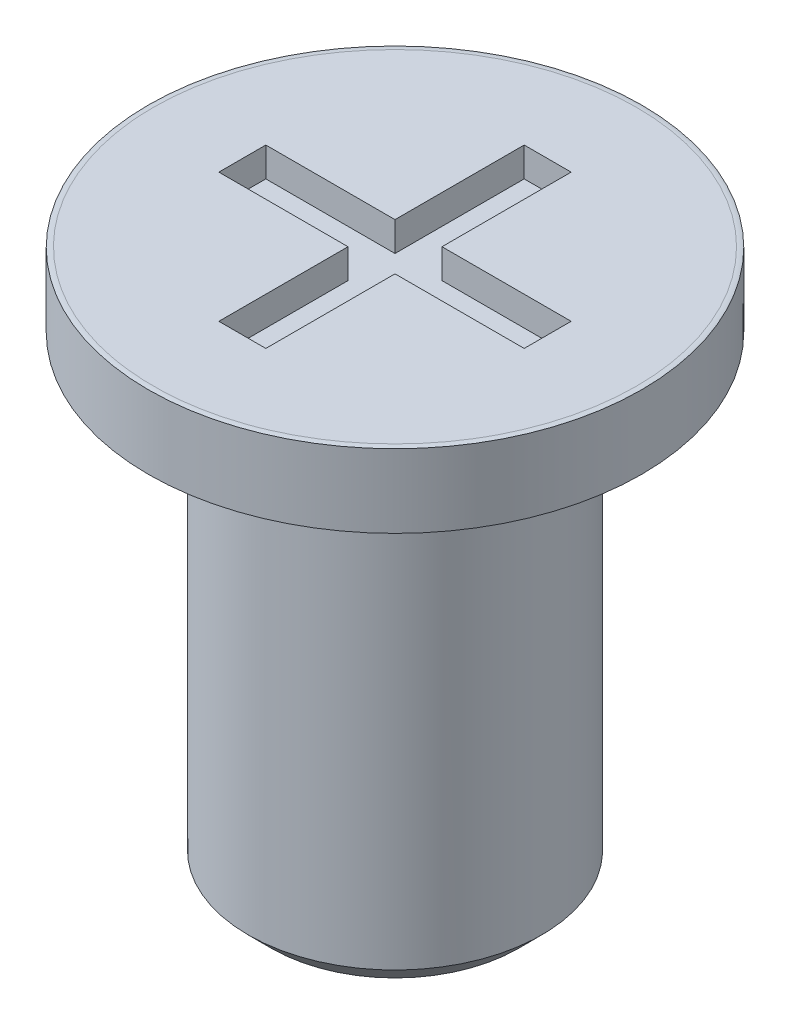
ISO-10303-21;
HEADER;
FILE_DESCRIPTION(('STEP AP214'),'2;1');
FILE_NAME('part.step','',(''),(''),'','','');
FILE_SCHEMA(('AUTOMOTIVE_DESIGN { 1 0 10303 214 1 1 1 1 }'));
ENDSEC;
DATA;
#1=APPLICATION_CONTEXT('core data for automotive mechanical design processes');
#2=APPLICATION_PROTOCOL_DEFINITION('international standard','automotive_design',2000,#1);
#3=PRODUCT_CONTEXT('',#1,'mechanical');
#4=PRODUCT('Part','Part','',(#3));
#5=PRODUCT_RELATED_PRODUCT_CATEGORY('part','',(#4));
#6=PRODUCT_DEFINITION_FORMATION('','',#4);
#7=PRODUCT_DEFINITION_CONTEXT('part definition',#1,'design');
#8=PRODUCT_DEFINITION('design','',#6,#7);
#9=PRODUCT_DEFINITION_SHAPE('','',#8);
#10=(LENGTH_UNIT() NAMED_UNIT(*) SI_UNIT(.MILLI.,.METRE.));
#11=(NAMED_UNIT(*) PLANE_ANGLE_UNIT() SI_UNIT($,.RADIAN.));
#12=(NAMED_UNIT(*) SI_UNIT($,.STERADIAN.) SOLID_ANGLE_UNIT());
#13=UNCERTAINTY_MEASURE_WITH_UNIT(LENGTH_MEASURE(1.E-05),#10,'distance_accuracy_value','');
#14=(GEOMETRIC_REPRESENTATION_CONTEXT(3) GLOBAL_UNCERTAINTY_ASSIGNED_CONTEXT((#13)) GLOBAL_UNIT_ASSIGNED_CONTEXT((#10,
#11,#12)) REPRESENTATION_CONTEXT('',''));
#15=CARTESIAN_POINT('',(0.,0.,0.));
#16=DIRECTION('',(0.,0.,1.));
#17=DIRECTION('',(1.,0.,0.));
#18=AXIS2_PLACEMENT_3D('',#15,#16,#17);
#19=CARTESIAN_POINT('',(0.,1.814213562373,0.));
#20=DIRECTION('',(0.,1.,0.));
#21=DIRECTION('',(0.,0.,1.));
#22=AXIS2_PLACEMENT_3D('',#19,#20,#21);
#23=PLANE('',#22);
#24=DIRECTION('',(0.,0.,1.));
#25=VECTOR('',#24,1.);
#26=CARTESIAN_POINT('',(-0.2,1.814213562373,0.2));
#27=LINE('',#26,#25);
#28=CARTESIAN_POINT('',(-0.2,1.814213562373,0.2));
#29=VERTEX_POINT('',#28);
#30=CARTESIAN_POINT('',(-0.2,1.814213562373,1.3));
#31=VERTEX_POINT('',#30);
#32=EDGE_CURVE('E321',#29,#31,#27,.T.);
#33=ORIENTED_EDGE('',*,*,#32,.T.);
#34=DIRECTION('',(1.,0.,0.));
#35=VECTOR('',#34,1.);
#36=CARTESIAN_POINT('',(0.,1.814213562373,1.3));
#37=LINE('',#36,#35);
#38=CARTESIAN_POINT('',(0.2,1.814213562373,1.3));
#39=VERTEX_POINT('',#38);
#40=EDGE_CURVE('E140',#31,#39,#37,.T.);
#41=ORIENTED_EDGE('',*,*,#40,.T.);
#42=DIRECTION('',(0.,0.,-1.));
#43=VECTOR('',#42,1.);
#44=CARTESIAN_POINT('',(0.2,1.814213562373,1.3));
#45=LINE('',#44,#43);
#46=CARTESIAN_POINT('',(0.2,1.814213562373,0.2));
#47=VERTEX_POINT('',#46);
#48=EDGE_CURVE('E137',#39,#47,#45,.T.);
#49=ORIENTED_EDGE('',*,*,#48,.T.);
#50=DIRECTION('',(1.,0.,0.));
#51=VECTOR('',#50,1.);
#52=CARTESIAN_POINT('',(0.2,1.814213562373,0.2));
#53=LINE('',#52,#51);
#54=CARTESIAN_POINT('',(1.3,1.814213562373,0.2));
#55=VERTEX_POINT('',#54);
#56=EDGE_CURVE('E134',#47,#55,#53,.T.);
#57=ORIENTED_EDGE('',*,*,#56,.T.);
#58=DIRECTION('',(0.,0.,-1.));
#59=VECTOR('',#58,1.);
#60=CARTESIAN_POINT('',(1.3,1.814213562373,0.2));
#61=LINE('',#60,#59);
#62=CARTESIAN_POINT('',(1.3,1.814213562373,-0.2));
#63=VERTEX_POINT('',#62);
#64=EDGE_CURVE('E157',#55,#63,#61,.T.);
#65=ORIENTED_EDGE('',*,*,#64,.T.);
#66=DIRECTION('',(-1.,0.,0.));
#67=VECTOR('',#66,1.);
#68=CARTESIAN_POINT('',(1.3,1.814213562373,-0.2));
#69=LINE('',#68,#67);
#70=CARTESIAN_POINT('',(0.2,1.814213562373,-0.2));
#71=VERTEX_POINT('',#70);
#72=EDGE_CURVE('E356',#63,#71,#69,.T.);
#73=ORIENTED_EDGE('',*,*,#72,.T.);
#74=DIRECTION('',(0.,0.,-1.));
#75=VECTOR('',#74,1.);
#76=CARTESIAN_POINT('',(0.2,1.814213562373,-0.2));
#77=LINE('',#76,#75);
#78=CARTESIAN_POINT('',(0.2,1.814213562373,-1.3));
#79=VERTEX_POINT('',#78);
#80=EDGE_CURVE('E351',#71,#79,#77,.T.);
#81=ORIENTED_EDGE('',*,*,#80,.T.);
#82=DIRECTION('',(-1.,0.,0.));
#83=VECTOR('',#82,1.);
#84=CARTESIAN_POINT('',(0.2,1.814213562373,-1.3));
#85=LINE('',#84,#83);
#86=CARTESIAN_POINT('',(-0.2,1.814213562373,-1.3));
#87=VERTEX_POINT('',#86);
#88=EDGE_CURVE('E346',#79,#87,#85,.T.);
#89=ORIENTED_EDGE('',*,*,#88,.T.);
#90=DIRECTION('',(0.,0.,1.));
#91=VECTOR('',#90,1.);
#92=CARTESIAN_POINT('',(-0.2,1.814213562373,-1.3));
#93=LINE('',#92,#91);
#94=CARTESIAN_POINT('',(-0.2,1.814213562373,-0.2));
#95=VERTEX_POINT('',#94);
#96=EDGE_CURVE('E341',#87,#95,#93,.T.);
#97=ORIENTED_EDGE('',*,*,#96,.T.);
#98=DIRECTION('',(-1.,0.,0.));
#99=VECTOR('',#98,1.);
#100=CARTESIAN_POINT('',(-0.2,1.814213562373,-0.2));
#101=LINE('',#100,#99);
#102=CARTESIAN_POINT('',(-1.3,1.814213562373,-0.2));
#103=VERTEX_POINT('',#102);
#104=EDGE_CURVE('E336',#95,#103,#101,.T.);
#105=ORIENTED_EDGE('',*,*,#104,.T.);
#106=DIRECTION('',(0.,0.,1.));
#107=VECTOR('',#106,1.);
#108=CARTESIAN_POINT('',(-1.3,1.814213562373,-0.2));
#109=LINE('',#108,#107);
#110=CARTESIAN_POINT('',(-1.3,1.814213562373,0.2));
#111=VERTEX_POINT('',#110);
#112=EDGE_CURVE('E331',#103,#111,#109,.T.);
#113=ORIENTED_EDGE('',*,*,#112,.T.);
#114=DIRECTION('',(1.,0.,0.));
#115=VECTOR('',#114,1.);
#116=CARTESIAN_POINT('',(-1.3,1.814213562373,0.2));
#117=LINE('',#116,#115);
#118=EDGE_CURVE('E326',#111,#29,#117,.T.);
#119=ORIENTED_EDGE('',*,*,#118,.T.);
#120=EDGE_LOOP('',(#33,#41,#49,#57,#65,#73,#81,#89,#97,#105,#113,#119));
#121=FACE_BOUND('',#120,.T.);
#122=ADVANCED_FACE('F17',(#121),#23,.T.);
#123=CARTESIAN_POINT('',(0.2,3.214213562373,1.3));
#124=DIRECTION('',(1.,0.,0.));
#125=DIRECTION('',(0.,0.,-1.));
#126=AXIS2_PLACEMENT_3D('',#123,#124,#125);
#127=PLANE('',#126);
#128=ORIENTED_EDGE('',*,*,#48,.F.);
#129=DIRECTION('',(0.,1.,0.));
#130=VECTOR('',#129,1.);
#131=CARTESIAN_POINT('',(0.2,3.214213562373,1.3));
#132=LINE('',#131,#130);
#133=CARTESIAN_POINT('',(0.2,2.064213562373,1.3));
#134=VERTEX_POINT('',#133);
#135=EDGE_CURVE('E310',#39,#134,#132,.T.);
#136=ORIENTED_EDGE('',*,*,#135,.T.);
#137=DIRECTION('',(0.,0.,-1.));
#138=VECTOR('',#137,1.);
#139=CARTESIAN_POINT('',(0.2,2.064213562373,2.5));
#140=LINE('',#139,#138);
#141=CARTESIAN_POINT('',(0.2,2.064213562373,0.2));
#142=VERTEX_POINT('',#141);
#143=EDGE_CURVE('E148',#134,#142,#140,.T.);
#144=ORIENTED_EDGE('',*,*,#143,.T.);
#145=DIRECTION('',(0.,1.,0.));
#146=VECTOR('',#145,1.);
#147=CARTESIAN_POINT('',(0.2,3.214213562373,0.2));
#148=LINE('',#147,#146);
#149=EDGE_CURVE('E143',#142,#47,#148,.F.);
#150=ORIENTED_EDGE('',*,*,#149,.T.);
#151=EDGE_LOOP('',(#128,#136,#144,#150));
#152=FACE_BOUND('',#151,.T.);
#153=ADVANCED_FACE('F146',(#152),#127,.F.);
#154=CARTESIAN_POINT('',(0.2,3.214213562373,0.2));
#155=DIRECTION('',(0.,0.,1.));
#156=DIRECTION('',(1.,0.,0.));
#157=AXIS2_PLACEMENT_3D('',#154,#155,#156);
#158=PLANE('',#157);
#159=ORIENTED_EDGE('',*,*,#56,.F.);
#160=ORIENTED_EDGE('',*,*,#149,.F.);
#161=DIRECTION('',(1.,0.,0.));
#162=VECTOR('',#161,1.);
#163=CARTESIAN_POINT('',(-2.5,2.064213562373,0.2));
#164=LINE('',#163,#162);
#165=CARTESIAN_POINT('',(1.3,2.064213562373,0.2));
#166=VERTEX_POINT('',#165);
#167=EDGE_CURVE('E420',#142,#166,#164,.T.);
#168=ORIENTED_EDGE('',*,*,#167,.T.);
#169=DIRECTION('',(0.,1.,0.));
#170=VECTOR('',#169,1.);
#171=CARTESIAN_POINT('',(1.3,3.214213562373,0.2));
#172=LINE('',#171,#170);
#173=EDGE_CURVE('E154',#166,#55,#172,.F.);
#174=ORIENTED_EDGE('',*,*,#173,.T.);
#175=EDGE_LOOP('',(#159,#160,#168,#174));
#176=FACE_BOUND('',#175,.T.);
#177=ADVANCED_FACE('F152',(#176),#158,.F.);
#178=CARTESIAN_POINT('',(1.3,3.214213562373,0.2));
#179=DIRECTION('',(1.,0.,0.));
#180=DIRECTION('',(0.,0.,-1.));
#181=AXIS2_PLACEMENT_3D('',#178,#179,#180);
#182=PLANE('',#181);
#183=ORIENTED_EDGE('',*,*,#64,.F.);
#184=ORIENTED_EDGE('',*,*,#173,.F.);
#185=DIRECTION('',(0.,0.,-1.));
#186=VECTOR('',#185,1.);
#187=CARTESIAN_POINT('',(1.3,2.064213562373,2.5));
#188=LINE('',#187,#186);
#189=CARTESIAN_POINT('',(1.3,2.064213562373,-0.2));
#190=VERTEX_POINT('',#189);
#191=EDGE_CURVE('E365',#166,#190,#188,.T.);
#192=ORIENTED_EDGE('',*,*,#191,.T.);
#193=DIRECTION('',(0.,1.,0.));
#194=VECTOR('',#193,1.);
#195=CARTESIAN_POINT('',(1.3,3.214213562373,-0.2));
#196=LINE('',#195,#194);
#197=EDGE_CURVE('E358',#190,#63,#196,.F.);
#198=ORIENTED_EDGE('',*,*,#197,.T.);
#199=EDGE_LOOP('',(#183,#184,#192,#198));
#200=FACE_BOUND('',#199,.T.);
#201=ADVANCED_FACE('F363',(#200),#182,.F.);
#202=CARTESIAN_POINT('',(1.3,3.214213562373,-0.2));
#203=DIRECTION('',(0.,0.,-1.));
#204=DIRECTION('',(-1.,0.,0.));
#205=AXIS2_PLACEMENT_3D('',#202,#203,#204);
#206=PLANE('',#205);
#207=ORIENTED_EDGE('',*,*,#72,.F.);
#208=ORIENTED_EDGE('',*,*,#197,.F.);
#209=DIRECTION('',(1.,0.,0.));
#210=VECTOR('',#209,1.);
#211=CARTESIAN_POINT('',(-2.5,2.064213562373,-0.2));
#212=LINE('',#211,#210);
#213=CARTESIAN_POINT('',(0.2,2.064213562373,-0.2));
#214=VERTEX_POINT('',#213);
#215=EDGE_CURVE('E371',#190,#214,#212,.F.);
#216=ORIENTED_EDGE('',*,*,#215,.T.);
#217=DIRECTION('',(0.,1.,0.));
#218=VECTOR('',#217,1.);
#219=CARTESIAN_POINT('',(0.2,3.214213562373,-0.2));
#220=LINE('',#219,#218);
#221=EDGE_CURVE('E353',#214,#71,#220,.F.);
#222=ORIENTED_EDGE('',*,*,#221,.T.);
#223=EDGE_LOOP('',(#207,#208,#216,#222));
#224=FACE_BOUND('',#223,.T.);
#225=ADVANCED_FACE('F368',(#224),#206,.F.);
#226=CARTESIAN_POINT('',(0.2,3.214213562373,-0.2));
#227=DIRECTION('',(1.,0.,0.));
#228=DIRECTION('',(0.,0.,-1.));
#229=AXIS2_PLACEMENT_3D('',#226,#227,#228);
#230=PLANE('',#229);
#231=ORIENTED_EDGE('',*,*,#80,.F.);
#232=ORIENTED_EDGE('',*,*,#221,.F.);
#233=DIRECTION('',(0.,0.,-1.));
#234=VECTOR('',#233,1.);
#235=CARTESIAN_POINT('',(0.2,2.064213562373,2.5));
#236=LINE('',#235,#234);
#237=CARTESIAN_POINT('',(0.2,2.064213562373,-1.3));
#238=VERTEX_POINT('',#237);
#239=EDGE_CURVE('E425',#214,#238,#236,.T.);
#240=ORIENTED_EDGE('',*,*,#239,.T.);
#241=DIRECTION('',(0.,1.,0.));
#242=VECTOR('',#241,1.);
#243=CARTESIAN_POINT('',(0.2,3.214213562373,-1.3));
#244=LINE('',#243,#242);
#245=EDGE_CURVE('E348',#238,#79,#244,.F.);
#246=ORIENTED_EDGE('',*,*,#245,.T.);
#247=EDGE_LOOP('',(#231,#232,#240,#246));
#248=FACE_BOUND('',#247,.T.);
#249=ADVANCED_FACE('F374',(#248),#230,.F.);
#250=CARTESIAN_POINT('',(0.2,3.214213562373,-1.3));
#251=DIRECTION('',(0.,0.,-1.));
#252=DIRECTION('',(-1.,0.,0.));
#253=AXIS2_PLACEMENT_3D('',#250,#251,#252);
#254=PLANE('',#253);
#255=ORIENTED_EDGE('',*,*,#88,.F.);
#256=ORIENTED_EDGE('',*,*,#245,.F.);
#257=DIRECTION('',(1.,0.,0.));
#258=VECTOR('',#257,1.);
#259=CARTESIAN_POINT('',(-2.5,2.064213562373,-1.3));
#260=LINE('',#259,#258);
#261=CARTESIAN_POINT('',(-0.2,2.064213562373,-1.3));
#262=VERTEX_POINT('',#261);
#263=EDGE_CURVE('E382',#238,#262,#260,.F.);
#264=ORIENTED_EDGE('',*,*,#263,.T.);
#265=DIRECTION('',(0.,1.,0.));
#266=VECTOR('',#265,1.);
#267=CARTESIAN_POINT('',(-0.2,3.214213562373,-1.3));
#268=LINE('',#267,#266);
#269=EDGE_CURVE('E343',#262,#87,#268,.F.);
#270=ORIENTED_EDGE('',*,*,#269,.T.);
#271=EDGE_LOOP('',(#255,#256,#264,#270));
#272=FACE_BOUND('',#271,.T.);
#273=ADVANCED_FACE('F380',(#272),#254,.F.);
#274=CARTESIAN_POINT('',(-0.2,3.214213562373,-1.3));
#275=DIRECTION('',(-1.,0.,0.));
#276=DIRECTION('',(0.,0.,1.));
#277=AXIS2_PLACEMENT_3D('',#274,#275,#276);
#278=PLANE('',#277);
#279=ORIENTED_EDGE('',*,*,#96,.F.);
#280=ORIENTED_EDGE('',*,*,#269,.F.);
#281=DIRECTION('',(0.,0.,-1.));
#282=VECTOR('',#281,1.);
#283=CARTESIAN_POINT('',(-0.2,2.064213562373,2.5));
#284=LINE('',#283,#282);
#285=CARTESIAN_POINT('',(-0.2,2.064213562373,-0.2));
#286=VERTEX_POINT('',#285);
#287=EDGE_CURVE('E388',#262,#286,#284,.F.);
#288=ORIENTED_EDGE('',*,*,#287,.T.);
#289=DIRECTION('',(0.,1.,0.));
#290=VECTOR('',#289,1.);
#291=CARTESIAN_POINT('',(-0.2,3.214213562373,-0.2));
#292=LINE('',#291,#290);
#293=EDGE_CURVE('E338',#286,#95,#292,.F.);
#294=ORIENTED_EDGE('',*,*,#293,.T.);
#295=EDGE_LOOP('',(#279,#280,#288,#294));
#296=FACE_BOUND('',#295,.T.);
#297=ADVANCED_FACE('F385',(#296),#278,.F.);
#298=CARTESIAN_POINT('',(-0.2,3.214213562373,-0.2));
#299=DIRECTION('',(0.,0.,-1.));
#300=DIRECTION('',(-1.,0.,0.));
#301=AXIS2_PLACEMENT_3D('',#298,#299,#300);
#302=PLANE('',#301);
#303=ORIENTED_EDGE('',*,*,#104,.F.);
#304=ORIENTED_EDGE('',*,*,#293,.F.);
#305=DIRECTION('',(1.,0.,0.));
#306=VECTOR('',#305,1.);
#307=CARTESIAN_POINT('',(-2.5,2.064213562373,-0.2));
#308=LINE('',#307,#306);
#309=CARTESIAN_POINT('',(-1.3,2.064213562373,-0.2));
#310=VERTEX_POINT('',#309);
#311=EDGE_CURVE('E429',#286,#310,#308,.F.);
#312=ORIENTED_EDGE('',*,*,#311,.T.);
#313=DIRECTION('',(0.,1.,0.));
#314=VECTOR('',#313,1.);
#315=CARTESIAN_POINT('',(-1.3,3.214213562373,-0.2));
#316=LINE('',#315,#314);
#317=EDGE_CURVE('E333',#310,#103,#316,.F.);
#318=ORIENTED_EDGE('',*,*,#317,.T.);
#319=EDGE_LOOP('',(#303,#304,#312,#318));
#320=FACE_BOUND('',#319,.T.);
#321=ADVANCED_FACE('F391',(#320),#302,.F.);
#322=CARTESIAN_POINT('',(-1.3,3.214213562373,-0.2));
#323=DIRECTION('',(-1.,0.,0.));
#324=DIRECTION('',(0.,0.,1.));
#325=AXIS2_PLACEMENT_3D('',#322,#323,#324);
#326=PLANE('',#325);
#327=ORIENTED_EDGE('',*,*,#112,.F.);
#328=ORIENTED_EDGE('',*,*,#317,.F.);
#329=DIRECTION('',(0.,0.,-1.));
#330=VECTOR('',#329,1.);
#331=CARTESIAN_POINT('',(-1.3,2.064213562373,2.5));
#332=LINE('',#331,#330);
#333=CARTESIAN_POINT('',(-1.3,2.064213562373,0.2));
#334=VERTEX_POINT('',#333);
#335=EDGE_CURVE('E399',#310,#334,#332,.F.);
#336=ORIENTED_EDGE('',*,*,#335,.T.);
#337=DIRECTION('',(0.,1.,0.));
#338=VECTOR('',#337,1.);
#339=CARTESIAN_POINT('',(-1.3,3.214213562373,0.2));
#340=LINE('',#339,#338);
#341=EDGE_CURVE('E328',#334,#111,#340,.F.);
#342=ORIENTED_EDGE('',*,*,#341,.T.);
#343=EDGE_LOOP('',(#327,#328,#336,#342));
#344=FACE_BOUND('',#343,.T.);
#345=ADVANCED_FACE('F397',(#344),#326,.F.);
#346=CARTESIAN_POINT('',(-1.3,3.214213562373,0.2));
#347=DIRECTION('',(0.,0.,1.));
#348=DIRECTION('',(1.,0.,0.));
#349=AXIS2_PLACEMENT_3D('',#346,#347,#348);
#350=PLANE('',#349);
#351=ORIENTED_EDGE('',*,*,#118,.F.);
#352=ORIENTED_EDGE('',*,*,#341,.F.);
#353=DIRECTION('',(1.,0.,0.));
#354=VECTOR('',#353,1.);
#355=CARTESIAN_POINT('',(-2.5,2.064213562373,0.2));
#356=LINE('',#355,#354);
#357=CARTESIAN_POINT('',(-0.2,2.064213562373,0.2));
#358=VERTEX_POINT('',#357);
#359=EDGE_CURVE('E405',#334,#358,#356,.T.);
#360=ORIENTED_EDGE('',*,*,#359,.T.);
#361=DIRECTION('',(0.,1.,0.));
#362=VECTOR('',#361,1.);
#363=CARTESIAN_POINT('',(-0.2,3.214213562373,0.2));
#364=LINE('',#363,#362);
#365=EDGE_CURVE('E323',#358,#29,#364,.F.);
#366=ORIENTED_EDGE('',*,*,#365,.T.);
#367=EDGE_LOOP('',(#351,#352,#360,#366));
#368=FACE_BOUND('',#367,.T.);
#369=ADVANCED_FACE('F402',(#368),#350,.F.);
#370=CARTESIAN_POINT('',(-0.2,3.214213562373,0.2));
#371=DIRECTION('',(-1.,0.,0.));
#372=DIRECTION('',(0.,0.,1.));
#373=AXIS2_PLACEMENT_3D('',#370,#371,#372);
#374=PLANE('',#373);
#375=ORIENTED_EDGE('',*,*,#32,.F.);
#376=ORIENTED_EDGE('',*,*,#365,.F.);
#377=DIRECTION('',(0.,0.,-1.));
#378=VECTOR('',#377,1.);
#379=CARTESIAN_POINT('',(-0.2,2.064213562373,2.5));
#380=LINE('',#379,#378);
#381=CARTESIAN_POINT('',(-0.2,2.064213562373,1.3));
#382=VERTEX_POINT('',#381);
#383=EDGE_CURVE('E410',#358,#382,#380,.F.);
#384=ORIENTED_EDGE('',*,*,#383,.T.);
#385=DIRECTION('',(0.,1.,0.));
#386=VECTOR('',#385,1.);
#387=CARTESIAN_POINT('',(-0.2,3.214213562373,1.3));
#388=LINE('',#387,#386);
#389=EDGE_CURVE('E318',#382,#31,#388,.F.);
#390=ORIENTED_EDGE('',*,*,#389,.T.);
#391=EDGE_LOOP('',(#375,#376,#384,#390));
#392=FACE_BOUND('',#391,.T.);
#393=ADVANCED_FACE('F408',(#392),#374,.F.);
#394=CARTESIAN_POINT('',(0.,3.214213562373,1.3));
#395=DIRECTION('',(0.,0.,1.));
#396=DIRECTION('',(1.,0.,0.));
#397=AXIS2_PLACEMENT_3D('',#394,#395,#396);
#398=PLANE('',#397);
#399=ORIENTED_EDGE('',*,*,#40,.F.);
#400=ORIENTED_EDGE('',*,*,#389,.F.);
#401=DIRECTION('',(1.,0.,0.));
#402=VECTOR('',#401,1.);
#403=CARTESIAN_POINT('',(-2.5,2.064213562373,1.3));
#404=LINE('',#403,#402);
#405=EDGE_CURVE('E415',#382,#134,#404,.T.);
#406=ORIENTED_EDGE('',*,*,#405,.T.);
#407=ORIENTED_EDGE('',*,*,#135,.F.);
#408=EDGE_LOOP('',(#399,#400,#406,#407));
#409=FACE_BOUND('',#408,.T.);
#410=ADVANCED_FACE('F414',(#409),#398,.F.);
#411=CARTESIAN_POINT('',(-2.5,2.064213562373,2.5));
#412=DIRECTION('',(0.,-1.,0.));
#413=DIRECTION('',(0.,0.,-1.));
#414=AXIS2_PLACEMENT_3D('',#411,#412,#413);
#415=PLANE('',#414);
#416=ORIENTED_EDGE('',*,*,#383,.F.);
#417=ORIENTED_EDGE('',*,*,#359,.F.);
#418=ORIENTED_EDGE('',*,*,#335,.F.);
#419=ORIENTED_EDGE('',*,*,#311,.F.);
#420=ORIENTED_EDGE('',*,*,#287,.F.);
#421=ORIENTED_EDGE('',*,*,#263,.F.);
#422=ORIENTED_EDGE('',*,*,#239,.F.);
#423=ORIENTED_EDGE('',*,*,#215,.F.);
#424=ORIENTED_EDGE('',*,*,#191,.F.);
#425=ORIENTED_EDGE('',*,*,#167,.F.);
#426=ORIENTED_EDGE('',*,*,#143,.F.);
#427=ORIENTED_EDGE('',*,*,#405,.F.);
#428=EDGE_LOOP('',(#416,#417,#418,#419,#420,#421,#422,#423,#424,#425,#426,#427));
#429=FACE_BOUND('',#428,.T.);
#430=CARTESIAN_POINT('',(0.,2.064213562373,0.));
#431=DIRECTION('',(0.,-1.,0.));
#432=DIRECTION('',(-0.999999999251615,0.,3.86880995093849E-05));
#433=AXIS2_PLACEMENT_3D('',#430,#431,#432);
#434=CIRCLE('',#433,2.05635183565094);
#435=CARTESIAN_POINT('',(-2.056351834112,2.064213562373,7.95563444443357E-05));
#436=VERTEX_POINT('',#435);
#437=CARTESIAN_POINT('',(2.056351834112,2.064213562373,-7.95563444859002E-05));
#438=VERTEX_POINT('',#437);
#439=EDGE_CURVE('E288',#436,#438,#434,.T.);
#440=ORIENTED_EDGE('',*,*,#439,.F.);
#441=CARTESIAN_POINT('',(2.056351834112,2.064213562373,-7.95563444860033E-05));
#442=CARTESIAN_POINT('',(2.05635348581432,2.064213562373,0.0303189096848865));
#443=CARTESIAN_POINT('',(2.05568014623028,2.064213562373,0.0607173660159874));
#444=CARTESIAN_POINT('',(2.05298689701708,2.064213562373,0.121454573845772));
#445=CARTESIAN_POINT('',(2.05096698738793,2.064213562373,0.151793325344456));
#446=CARTESIAN_POINT('',(2.04558401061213,2.064213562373,0.212351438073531));
#447=CARTESIAN_POINT('',(2.04222094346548,2.06421356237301,0.242570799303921));
#448=CARTESIAN_POINT('',(2.03415841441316,2.06421356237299,0.30283072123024));
#449=CARTESIAN_POINT('',(2.02945895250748,2.06421356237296,0.332871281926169));
#450=CARTESIAN_POINT('',(2.01873283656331,2.06421356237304,0.392714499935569));
#451=CARTESIAN_POINT('',(2.0127061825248,2.06421356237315,0.42251715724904));
#452=CARTESIAN_POINT('',(1.99933753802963,2.06421356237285,0.481826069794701));
#453=CARTESIAN_POINT('',(1.99199554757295,2.06421356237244,0.511332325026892));
#454=CARTESIAN_POINT('',(1.97601068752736,2.06421356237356,0.5699900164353));
#455=CARTESIAN_POINT('',(1.96736781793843,2.0642135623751,0.599141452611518));
#456=CARTESIAN_POINT('',(1.94879811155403,2.0642135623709,0.657033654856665));
#457=CARTESIAN_POINT('',(1.93887127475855,2.06421356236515,0.685774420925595));
#458=CARTESIAN_POINT('',(1.92303259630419,2.06421356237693,0.728531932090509));
#459=CARTESIAN_POINT('',(1.91759478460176,2.06421356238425,0.742725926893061));
#460=CARTESIAN_POINT('',(1.905943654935,2.06421356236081,0.77216260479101));
#461=CARTESIAN_POINT('',(1.89970342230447,2.06421356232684,0.787394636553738));
#462=CARTESIAN_POINT('',(1.88044341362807,2.06421356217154,0.832860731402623));
#463=CARTESIAN_POINT('',(1.86688316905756,2.06421356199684,0.86286793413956));
#464=CARTESIAN_POINT('',(1.83835391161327,2.0642135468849,0.92220246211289));
#465=CARTESIAN_POINT('',(1.82338492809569,2.06421353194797,0.951529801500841));
#466=CARTESIAN_POINT('',(1.7920681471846,2.0642134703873,1.00944053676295));
#467=CARTESIAN_POINT('',(1.77572034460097,2.06421342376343,1.03802392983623));
#468=CARTESIAN_POINT('',(1.74594801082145,2.06421325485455,1.08733980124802));
#469=CARTESIAN_POINT('',(1.73281414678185,2.06421315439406,1.10824885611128));
#470=CARTESIAN_POINT('',(1.69674419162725,2.06421287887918,1.16340934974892));
#471=CARTESIAN_POINT('',(1.67313144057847,2.06421269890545,1.19722344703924));
#472=CARTESIAN_POINT('',(1.62877376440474,2.06421262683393,1.25669096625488));
#473=CARTESIAN_POINT('',(1.6084003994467,2.06421268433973,1.28262345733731));
#474=CARTESIAN_POINT('',(1.56642014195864,2.06421292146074,1.33346415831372));
#475=CARTESIAN_POINT('',(1.54481353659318,2.06421310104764,1.35837260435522));
#476=CARTESIAN_POINT('',(1.50031752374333,2.06421340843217,1.40699892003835));
#477=CARTESIAN_POINT('',(1.47742850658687,2.06421353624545,1.43071714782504));
#478=CARTESIAN_POINT('',(1.44390323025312,2.06421357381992,1.46420646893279));
#479=CARTESIAN_POINT('',(1.43360870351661,2.06421356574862,1.47432607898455));
#480=CARTESIAN_POINT('',(1.39402327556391,2.06421353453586,1.51241032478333));
#481=CARTESIAN_POINT('',(1.36398692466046,2.06421351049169,1.5396120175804));
#482=CARTESIAN_POINT('',(1.31391536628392,2.06421341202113,1.58236135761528));
#483=CARTESIAN_POINT('',(1.29434518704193,2.06421335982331,1.59845990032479));
#484=CARTESIAN_POINT('',(1.25898255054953,2.06421325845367,1.62646119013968));
#485=CARTESIAN_POINT('',(1.24330470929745,2.0642132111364,1.63850872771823));
#486=CARTESIAN_POINT('',(1.20097579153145,2.06421310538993,1.67005830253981));
#487=CARTESIAN_POINT('',(1.17401244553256,2.064213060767,1.68914497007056));
#488=CARTESIAN_POINT('',(1.13536162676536,2.06421304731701,1.71510554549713));
#489=CARTESIAN_POINT('',(1.12404720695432,2.0642130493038,1.7225409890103));
#490=CARTESIAN_POINT('',(1.10158012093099,2.06421306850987,1.73698179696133));
#491=CARTESIAN_POINT('',(1.09043143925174,2.06421308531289,1.74399335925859));
#492=CARTESIAN_POINT('',(1.0499112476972,2.06421315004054,1.76893350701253));
#493=CARTESIAN_POINT('',(1.02014800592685,2.06421320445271,1.78623182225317));
#494=CARTESIAN_POINT('',(0.963513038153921,2.06421329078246,1.81727699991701));
#495=CARTESIAN_POINT('',(0.936736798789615,2.06421332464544,1.83119884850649));
#496=CARTESIAN_POINT('',(0.889101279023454,2.06421337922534,1.85464880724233));
#497=CARTESIAN_POINT('',(0.868365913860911,2.06421340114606,1.86442896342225));
#498=CARTESIAN_POINT('',(0.829538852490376,2.06421343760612,1.88195543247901));
#499=CARTESIAN_POINT('',(0.811488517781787,2.06421345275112,1.88979365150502));
#500=CARTESIAN_POINT('',(0.765995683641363,2.06421348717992,1.90877673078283));
#501=CARTESIAN_POINT('',(0.738414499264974,2.06421350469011,1.91959194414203));
#502=CARTESIAN_POINT('',(0.694999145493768,2.06421352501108,1.93554670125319));
#503=CARTESIAN_POINT('',(0.679314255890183,2.06421353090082,1.94109637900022));
#504=CARTESIAN_POINT('',(0.65983763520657,2.06421353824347,1.94772098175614));
#505=CARTESIAN_POINT('',(0.656107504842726,2.06421353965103,1.94897769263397));
#506=CARTESIAN_POINT('',(0.644146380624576,2.06421353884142,1.95298009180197));
#507=CARTESIAN_POINT('',(0.635905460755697,2.06421353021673,1.9556961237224));
#508=CARTESIAN_POINT('',(0.598742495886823,2.064213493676,1.96767233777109));
#509=CARTESIAN_POINT('',(0.569619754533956,2.06421347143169,1.97631894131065));
#510=CARTESIAN_POINT('',(0.511021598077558,2.06421342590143,1.99231487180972));
#511=CARTESIAN_POINT('',(0.481546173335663,2.06421340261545,1.99966416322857));
#512=CARTESIAN_POINT('',(0.422294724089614,2.0642133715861,2.01303558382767));
#513=CARTESIAN_POINT('',(0.39251869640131,2.0642133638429,2.01905769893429));
#514=CARTESIAN_POINT('',(0.332727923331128,2.06421336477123,2.02976677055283));
#515=CARTESIAN_POINT('',(0.302713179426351,2.06421337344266,2.03445373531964));
#516=CARTESIAN_POINT('',(0.242504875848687,2.0642134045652,2.04248153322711));
#517=CARTESIAN_POINT('',(0.212311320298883,2.06421342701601,2.04582239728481));
#518=CARTESIAN_POINT('',(0.151806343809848,2.06421347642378,2.05115343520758));
#519=CARTESIAN_POINT('',(0.121494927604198,2.06421350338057,2.05314366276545));
#520=CARTESIAN_POINT('',(0.0608151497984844,2.06421354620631,2.05576270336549));
#521=CARTESIAN_POINT('',(0.0304467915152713,2.06421356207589,2.05639159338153));
#522=CARTESIAN_POINT('',(-0.0302816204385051,2.06421356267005,2.05631208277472));
#523=CARTESIAN_POINT('',(-0.0606416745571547,2.06421354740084,2.05560394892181));
#524=CARTESIAN_POINT('',(-0.121299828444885,2.06421352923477,2.0528769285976));
#525=CARTESIAN_POINT('',(-0.151597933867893,2.06421352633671,2.05085816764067));
#526=CARTESIAN_POINT('',(-0.212076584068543,2.06421353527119,2.04550897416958));
#527=CARTESIAN_POINT('',(-0.242257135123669,2.06421354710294,2.04217861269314));
#528=CARTESIAN_POINT('',(-0.30244448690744,2.06421356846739,2.0342078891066));
#529=CARTESIAN_POINT('',(-0.332451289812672,2.06421357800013,2.0295675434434));
#530=CARTESIAN_POINT('',(-0.387968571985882,2.06421349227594,2.01976333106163));
#531=CARTESIAN_POINT('',(-0.41350915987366,2.0642134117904,2.01476888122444));
#532=CARTESIAN_POINT('',(-0.472859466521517,2.06421320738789,2.00194614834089));
#533=CARTESIAN_POINT('',(-0.506586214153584,2.06421307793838,1.99372827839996));
#534=CARTESIAN_POINT('',(-0.56934457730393,2.06421317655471,1.97660956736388));
#535=CARTESIAN_POINT('',(-0.598434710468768,2.06421336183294,1.96792352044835));
#536=CARTESIAN_POINT('',(-0.635534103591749,2.06421351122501,1.9558481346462));
#537=CARTESIAN_POINT('',(-0.643757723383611,2.06421353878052,1.95310761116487));
#538=CARTESIAN_POINT('',(-0.664146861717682,2.06421357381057,1.94620140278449));
#539=CARTESIAN_POINT('',(-0.67629598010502,2.06421356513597,1.94198726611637));
#540=CARTESIAN_POINT('',(-0.718475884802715,2.06421354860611,1.92694924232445));
#541=CARTESIAN_POINT('',(-0.748317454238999,2.06421356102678,1.91558740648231));
#542=CARTESIAN_POINT('',(-0.808209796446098,2.0642135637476,1.89118866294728));
#543=CARTESIAN_POINT('',(-0.838246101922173,2.06421355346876,1.87811610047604));
#544=CARTESIAN_POINT('',(-0.876479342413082,2.06421351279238,1.86038617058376));
#545=CARTESIAN_POINT('',(-0.884979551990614,2.06421350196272,1.85637380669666));
#546=CARTESIAN_POINT('',(-0.923103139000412,2.06421344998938,1.83805364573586));
#547=CARTESIAN_POINT('',(-0.952412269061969,2.06421340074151,1.82308264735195));
#548=CARTESIAN_POINT('',(-1.01027015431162,2.06421331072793,1.79173949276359));
#549=CARTESIAN_POINT('',(-1.03881888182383,2.06421326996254,1.77536728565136));
#550=CARTESIAN_POINT('',(-1.09509019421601,2.06421321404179,1.74125795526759));
#551=CARTESIAN_POINT('',(-1.12281276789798,2.06421319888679,1.72352081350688));
#552=CARTESIAN_POINT('',(-1.17736629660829,2.06421319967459,1.68672518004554));
#553=CARTESIAN_POINT('',(-1.2041972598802,2.06421321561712,1.66766670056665));
#554=CARTESIAN_POINT('',(-1.25690081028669,2.06421327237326,1.62827003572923));
#555=CARTESIAN_POINT('',(-1.28277342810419,2.06421331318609,1.60793189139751));
#556=CARTESIAN_POINT('',(-1.33351129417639,2.06421340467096,1.56603706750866));
#557=CARTESIAN_POINT('',(-1.35837659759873,2.06421345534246,1.54448045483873));
#558=CARTESIAN_POINT('',(-1.40699493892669,2.06421353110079,1.50015218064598));
#559=CARTESIAN_POINT('',(-1.43074806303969,2.0642135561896,1.47738061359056));
#560=CARTESIAN_POINT('',(-1.46700429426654,2.06421356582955,1.44111187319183));
#561=CARTESIAN_POINT('',(-1.47984917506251,2.06421356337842,1.42795327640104));
#562=CARTESIAN_POINT('',(-1.50754976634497,2.06421355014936,1.39880595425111));
#563=CARTESIAN_POINT('',(-1.5223327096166,2.06421353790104,1.38274785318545));
#564=CARTESIAN_POINT('',(-1.5568862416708,2.06421348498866,1.34400112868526));
#565=CARTESIAN_POINT('',(-1.57642506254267,2.06421343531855,1.32110493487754));
#566=CARTESIAN_POINT('',(-1.60552526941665,2.06421333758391,1.28544281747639));
#567=CARTESIAN_POINT('',(-1.61545705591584,2.06421329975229,1.27297733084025));
#568=CARTESIAN_POINT('',(-1.63451254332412,2.06421322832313,1.2484732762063));
#569=CARTESIAN_POINT('',(-1.64365135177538,2.06421319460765,1.23644643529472));
#570=CARTESIAN_POINT('',(-1.67564028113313,2.0642130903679,1.19335409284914));
#571=CARTESIAN_POINT('',(-1.69774381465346,2.06421304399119,1.16172698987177));
#572=CARTESIAN_POINT('',(-1.73249895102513,2.06421304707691,1.10883212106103));
#573=CARTESIAN_POINT('',(-1.7456963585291,2.06421306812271,1.08791900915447));
#574=CARTESIAN_POINT('',(-1.77559388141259,2.06421313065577,1.03857925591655));
#575=CARTESIAN_POINT('',(-1.79199595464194,2.0642131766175,1.00997085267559));
#576=CARTESIAN_POINT('',(-1.82338940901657,2.06421328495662,0.951995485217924));
#577=CARTESIAN_POINT('',(-1.83838092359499,2.06421334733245,0.922628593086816));
#578=CARTESIAN_POINT('',(-1.86692233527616,2.0642134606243,0.863204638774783));
#579=CARTESIAN_POINT('',(-1.88047239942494,2.06421351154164,0.833147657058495));
#580=CARTESIAN_POINT('',(-1.89968626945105,2.06421355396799,0.787598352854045));
#581=CARTESIAN_POINT('',(-1.90590561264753,2.06421356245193,0.772338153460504));
#582=CARTESIAN_POINT('',(-1.91751053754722,2.0642135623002,0.742865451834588));
#583=CARTESIAN_POINT('',(-1.92292335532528,2.0642135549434,0.728663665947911));
#584=CARTESIAN_POINT('',(-1.93870198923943,2.06421353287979,0.685893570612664));
#585=CARTESIAN_POINT('',(-1.94861028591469,2.06421351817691,0.657155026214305));
#586=CARTESIAN_POINT('',(-1.96718538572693,2.06421351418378,0.599284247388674));
#587=CARTESIAN_POINT('',(-1.97585235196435,2.06421352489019,0.570152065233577));
#588=CARTESIAN_POINT('',(-1.99191069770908,2.06421357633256,0.511540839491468));
#589=CARTESIAN_POINT('',(-1.99930216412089,2.06421361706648,0.482061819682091));
#590=CARTESIAN_POINT('',(-2.01117864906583,2.06421345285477,0.430230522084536));
#591=CARTESIAN_POINT('',(-2.01592832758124,2.06421330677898,0.407938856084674));
#592=CARTESIAN_POINT('',(-2.02505254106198,2.06421318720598,0.360608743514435));
#593=CARTESIAN_POINT('',(-2.02932079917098,2.06421323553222,0.335549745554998));
#594=CARTESIAN_POINT('',(-2.03894985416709,2.06421335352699,0.271950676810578));
#595=CARTESIAN_POINT('',(-2.04368783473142,2.06421342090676,0.233315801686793));
#596=CARTESIAN_POINT('',(-2.05124468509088,2.0642135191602,0.152729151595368));
#597=CARTESIAN_POINT('',(-2.05387912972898,2.06421354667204,0.110759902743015));
#598=CARTESIAN_POINT('',(-2.05598936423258,2.06421356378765,0.0458685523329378));
#599=CARTESIAN_POINT('',(-2.05635710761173,2.06421356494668,0.0229727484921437));
#600=CARTESIAN_POINT('',(-2.056351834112,2.064213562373,7.95563444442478E-05));
#601=B_SPLINE_CURVE_WITH_KNOTS('',3,(#441,#442,#443,#444,#445,#446,#447,#448,#449,#450,#451,
#452,#453,#454,#455,#456,#457,#458,#459,#460,#461,#462,#463,#464,#465,#466,#467,#468,#469,#470,
#471,#472,#473,#474,#475,#476,#477,#478,#479,#480,#481,#482,#483,#484,#485,#486,#487,#488,#489,
#490,#491,#492,#493,#494,#495,#496,#497,#498,#499,#500,#501,#502,#503,#504,#505,#506,#507,#508,
#509,#510,#511,#512,#513,#514,#515,#516,#517,#518,#519,#520,#521,#522,#523,#524,#525,#526,#527,
#528,#529,#530,#531,#532,#533,#534,#535,#536,#537,#538,#539,#540,#541,#542,#543,#544,#545,#546,
#547,#548,#549,#550,#551,#552,#553,#554,#555,#556,#557,#558,#559,#560,#561,#562,#563,#564,#565,
#566,#567,#568,#569,#570,#571,#572,#573,#574,#575,#576,#577,#578,#579,#580,#581,#582,#583,#584,
#585,#586,#587,#588,#589,#590,#591,#592,#593,#594,#595,#596,#597,#598,#599,#600),.UNSPECIFIED.,
.F.,.F.,(4,2,2,2,2,2,2,2,2,2,2,2,2,2,2,2,2,2,2,2,2,2,2,2,2,2,2,2,2,2,2,2,2,2,2,2,2,2,2,2,2,2,2,
2,2,2,2,2,2,2,2,2,2,2,2,2,2,2,2,2,2,2,2,2,2,2,2,2,2,2,2,2,2,2,2,2,2,2,2,4),(0.,
0.0911878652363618,0.182375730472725,0.273563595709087,0.364751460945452,0.455939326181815,
0.547127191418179,0.638315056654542,0.729502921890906,0.775099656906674,0.824477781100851,
0.923223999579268,1.02196816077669,1.12071269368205,1.1947758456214,1.31841415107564,
1.41731323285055,1.51618937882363,1.61503559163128,1.65834179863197,1.7798232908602,
1.85583086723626,1.91514010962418,2.01419845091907,2.05481310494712,2.09432184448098,
2.19754792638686,2.28805730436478,2.35682260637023,2.41585182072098,2.50469794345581,
2.55460666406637,2.56641504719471,2.59244561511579,2.68354799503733,2.7746528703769,
2.86575871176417,2.95686398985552,3.04796717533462,3.13906673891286,3.23016115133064,
3.32123739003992,3.41230490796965,3.5033674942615,3.59442893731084,3.67248518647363,
3.77657359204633,3.86761226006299,3.89361663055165,3.93219316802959,4.02795385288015,
4.126185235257,4.15438386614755,4.25307360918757,4.35176693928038,4.45046160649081,
4.5491553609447,4.64784595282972,4.74653113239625,4.84520864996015,4.90036986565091,
4.9658387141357,5.05610602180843,5.10391685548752,5.14922946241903,5.26491006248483,
5.33908453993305,5.43797309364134,5.53685228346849,5.63572000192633,5.68515253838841,
5.73074445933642,5.82191043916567,5.91306442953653,6.00421220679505,6.07257473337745,
6.14881388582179,6.26552432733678,6.39159658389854,6.46027920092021),.UNSPECIFIED.);
#602=EDGE_CURVE('E417',#438,#436,#601,.T.);
#603=ORIENTED_EDGE('',*,*,#602,.F.);
#604=EDGE_LOOP('',(#440,#603));
#605=FACE_BOUND('',#604,.T.);
#606=ADVANCED_FACE('F298',(#429,#605),#415,.F.);
#607=CARTESIAN_POINT('',(0.,1.864213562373,0.));
#608=DIRECTION('',(0.,-1.,0.));
#609=DIRECTION('',(-0.999999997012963,0.,7.72921300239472E-05));
#610=AXIS2_PLACEMENT_3D('',#607,#608,#609);
#611=TOROIDAL_SURFACE('',#610,2.056351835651,0.2);
#612=ORIENTED_EDGE('',*,*,#602,.T.);
#613=ORIENTED_EDGE('',*,*,#439,.T.);
#614=EDGE_LOOP('',(#612,#613));
#615=FACE_BOUND('',#614,.T.);
#616=CARTESIAN_POINT('',(0.,2.059392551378,0.));
#617=DIRECTION('',(0.,1.,0.));
#618=DIRECTION('',(0.,0.,1.));
#619=AXIS2_PLACEMENT_3D('',#616,#617,#618);
#620=CIRCLE('',#619,2.1);
#621=CARTESIAN_POINT('',(0.,2.059392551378,2.1));
#622=VERTEX_POINT('',#621);
#623=EDGE_CURVE('E181',#622,#622,#620,.F.);
#624=ORIENTED_EDGE('',*,*,#623,.F.);
#625=EDGE_LOOP('',(#624));
#626=FACE_BOUND('',#625,.T.);
#627=ADVANCED_FACE('F293',(#615,#626),#611,.T.);
#628=CARTESIAN_POINT('',(0.,2.064213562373,0.));
#629=DIRECTION('',(0.,1.,0.));
#630=DIRECTION('',(0.,0.,1.));
#631=AXIS2_PLACEMENT_3D('',#628,#629,#630);
#632=CYLINDRICAL_SURFACE('',#631,2.1);
#633=ORIENTED_EDGE('',*,*,#623,.T.);
#634=EDGE_LOOP('',(#633));
#635=FACE_BOUND('',#634,.T.);
#636=CARTESIAN_POINT('',(0.,1.43508477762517,0.));
#637=DIRECTION('',(0.,-1.,0.));
#638=DIRECTION('',(-0.99998257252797,0.,0.00590378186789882));
#639=AXIS2_PLACEMENT_3D('',#636,#637,#638);
#640=CIRCLE('',#639,2.09999999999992);
#641=CARTESIAN_POINT('',(-2.09996340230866,1.43508477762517,0.0123979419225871));
#642=VERTEX_POINT('',#641);
#643=EDGE_CURVE('E176',#642,#642,#640,.T.);
#644=ORIENTED_EDGE('',*,*,#643,.F.);
#645=EDGE_LOOP('',(#644));
#646=FACE_BOUND('',#645,.T.);
#647=ADVANCED_FACE('F297',(#635,#646),#632,.T.);
#648=CARTESIAN_POINT('',(0.,1.664213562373,0.));
#649=DIRECTION('',(0.,-1.,0.));
#650=DIRECTION('',(-0.99998257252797,0.,0.00590378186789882));
#651=AXIS2_PLACEMENT_3D('',#648,#649,#650);
#652=TOROIDAL_SURFACE('',#651,2.,0.25);
#653=CARTESIAN_POINT('',(-1.999965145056,1.414213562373,0.0118075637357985));
#654=CARTESIAN_POINT('',(-1.9997841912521,1.414213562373,0.042549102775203));
#655=CARTESIAN_POINT('',(-1.9988933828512,1.414213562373,0.0732864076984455));
#656=CARTESIAN_POINT('',(-1.99569632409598,1.414213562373,0.134687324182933));
#657=CARTESIAN_POINT('',(-1.99339007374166,1.414213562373,0.165350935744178));
#658=CARTESIAN_POINT('',(-1.98736639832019,1.414213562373,0.226539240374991));
#659=CARTESIAN_POINT('',(-1.98364897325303,1.414213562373,0.257063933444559));
#660=CARTESIAN_POINT('',(-1.97481102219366,1.414213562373,0.317909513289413));
#661=CARTESIAN_POINT('',(-1.96969049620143,1.414213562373,0.348230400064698));
#662=CARTESIAN_POINT('',(-1.95805718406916,1.414213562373,0.408603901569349));
#663=CARTESIAN_POINT('',(-1.95154439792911,1.414213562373,0.438656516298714));
#664=CARTESIAN_POINT('',(-1.93714042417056,1.414213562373,0.498429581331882));
#665=CARTESIAN_POINT('',(-1.92924923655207,1.414213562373,0.528150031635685));
#666=CARTESIAN_POINT('',(-1.91210523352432,1.414213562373,0.58719558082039));
#667=CARTESIAN_POINT('',(-1.90285241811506,1.414213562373,0.616520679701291));
#668=CARTESIAN_POINT('',(-1.88300483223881,1.414213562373,0.674713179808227));
#669=CARTESIAN_POINT('',(-1.87241006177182,1.414213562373,0.703580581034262));
#670=CARTESIAN_POINT('',(-1.84990109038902,1.414213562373,0.760796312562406));
#671=CARTESIAN_POINT('',(-1.8379868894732,1.414213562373,0.789144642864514));
#672=CARTESIAN_POINT('',(-1.81286438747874,1.414213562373,0.845261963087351));
#673=CARTESIAN_POINT('',(-1.7996560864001,1.41421356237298,0.87303095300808));
#674=CARTESIAN_POINT('',(-1.77197346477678,1.41421356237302,0.927930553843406));
#675=CARTESIAN_POINT('',(-1.75749914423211,1.41421356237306,0.955061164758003));
#676=CARTESIAN_POINT('',(-1.72731525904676,1.41421356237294,1.00862632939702));
#677=CARTESIAN_POINT('',(-1.71160569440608,1.41421356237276,1.03506088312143));
#678=CARTESIAN_POINT('',(-1.67898471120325,1.41421356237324,1.08717772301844));
#679=CARTESIAN_POINT('',(-1.6620732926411,1.41421356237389,1.11286000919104));
#680=CARTESIAN_POINT('',(-1.62708458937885,1.41421356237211,1.16341774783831));
#681=CARTESIAN_POINT('',(-1.60900730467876,1.41421356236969,1.188293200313));
#682=CARTESIAN_POINT('',(-1.57172517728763,1.41421356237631,1.23718425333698));
#683=CARTESIAN_POINT('',(-1.55252033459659,1.41421356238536,1.26119985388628));
#684=CARTESIAN_POINT('',(-1.51302438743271,1.41421356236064,1.30832063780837));
#685=CARTESIAN_POINT('',(-1.49273328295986,1.41421356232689,1.33142582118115));
#686=CARTESIAN_POINT('',(-1.45110621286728,1.41421356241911,1.37667480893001));
#687=CARTESIAN_POINT('',(-1.42977024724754,1.41421356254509,1.39881861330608));
#688=CARTESIAN_POINT('',(-1.3852173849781,1.41421356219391,1.44298484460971));
#689=CARTESIAN_POINT('',(-1.36195928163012,1.41421356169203,1.46496570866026));
#690=CARTESIAN_POINT('',(-1.31442766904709,1.4142135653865,1.50780055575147));
#691=CARTESIAN_POINT('',(-1.29015417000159,1.41421356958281,1.52865455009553));
#692=CARTESIAN_POINT('',(-1.24064386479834,1.41421359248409,1.56918450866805));
#693=CARTESIAN_POINT('',(-1.21540704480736,1.41421361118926,1.58886045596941));
#694=CARTESIAN_POINT('',(-1.15760625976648,1.41421371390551,1.63176835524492));
#695=CARTESIAN_POINT('',(-1.12478776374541,1.41421381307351,1.65465961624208));
#696=CARTESIAN_POINT('',(-1.07124660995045,1.41421402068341,1.68965351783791));
#697=CARTESIAN_POINT('',(-1.05094432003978,1.41421410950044,1.70240488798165));
#698=CARTESIAN_POINT('',(-1.00303474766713,1.4142142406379,1.73126562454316));
#699=CARTESIAN_POINT('',(-0.97524745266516,1.4142142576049,1.74707818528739));
#700=CARTESIAN_POINT('',(-0.918929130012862,1.41421418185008,1.7773039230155));
#701=CARTESIAN_POINT('',(-0.890398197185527,1.41421408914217,1.79171727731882));
#702=CARTESIAN_POINT('',(-0.832671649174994,1.41421385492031,1.81913752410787));
#703=CARTESIAN_POINT('',(-0.803476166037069,1.41421371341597,1.83214469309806));
#704=CARTESIAN_POINT('',(-0.759208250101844,1.41421359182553,1.85049361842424));
#705=CARTESIAN_POINT('',(-0.74437403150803,1.41421356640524,1.85641598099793));
#706=CARTESIAN_POINT('',(-0.724520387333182,1.41421356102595,1.8641510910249));
#707=CARTESIAN_POINT('',(-0.719543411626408,1.41421356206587,1.86607421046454));
#708=CARTESIAN_POINT('',(-0.688202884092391,1.4142135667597,1.87805199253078));
#709=CARTESIAN_POINT('',(-0.661647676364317,1.41421356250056,1.88761339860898));
#710=CARTESIAN_POINT('',(-0.606921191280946,1.41421357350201,1.90601117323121));
#711=CARTESIAN_POINT('',(-0.578731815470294,1.41421358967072,1.91479386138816));
#712=CARTESIAN_POINT('',(-0.537912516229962,1.41421362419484,1.92653122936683));
#713=CARTESIAN_POINT('',(-0.525425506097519,1.41421363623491,1.929991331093));
#714=CARTESIAN_POINT('',(-0.483434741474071,1.41421367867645,1.94118457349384));
#715=CARTESIAN_POINT('',(-0.453779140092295,1.41421371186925,1.94836110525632));
#716=CARTESIAN_POINT('',(-0.405403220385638,1.41421374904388,1.95888558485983));
#717=CARTESIAN_POINT('',(-0.386772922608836,1.41421375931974,1.96265723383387));
#718=CARTESIAN_POINT('',(-0.331849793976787,1.41421377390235,1.97295122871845));
#719=CARTESIAN_POINT('',(-0.295413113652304,1.41421376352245,1.97872730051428));
#720=CARTESIAN_POINT('',(-0.229593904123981,1.41421372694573,1.98728589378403));
#721=CARTESIAN_POINT('',(-0.200258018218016,1.41421370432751,1.99043608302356));
#722=CARTESIAN_POINT('',(-0.14147555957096,1.41421365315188,1.99542364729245));
#723=CARTESIAN_POINT('',(-0.112028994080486,1.41421362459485,1.99726110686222));
#724=CARTESIAN_POINT('',(-0.0530859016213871,1.41421357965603,1.99961178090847));
#725=CARTESIAN_POINT('',(-0.0235893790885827,1.41421356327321,2.00012510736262));
#726=CARTESIAN_POINT('',(0.035441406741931,1.41421356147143,1.99985726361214));
#727=CARTESIAN_POINT('',(0.0649756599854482,1.41421357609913,1.99907414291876));
#728=CARTESIAN_POINT('',(0.123981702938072,1.41421359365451,1.99624786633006));
#729=CARTESIAN_POINT('',(0.153453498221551,1.41421359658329,1.99420482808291));
#730=CARTESIAN_POINT('',(0.212276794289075,1.41421356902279,1.98883726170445));
#731=CARTESIAN_POINT('',(0.241628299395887,1.41421353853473,1.98551278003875));
#732=CARTESIAN_POINT('',(0.307493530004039,1.41421359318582,1.97667142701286));
#733=CARTESIAN_POINT('',(0.34396347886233,1.4142137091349,1.97081424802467));
#734=CARTESIAN_POINT('',(0.391347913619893,1.41421377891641,1.96170967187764));
#735=CARTESIAN_POINT('',(0.402459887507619,1.41421378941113,1.95946611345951));
#736=CARTESIAN_POINT('',(0.446095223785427,1.41421379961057,1.95024831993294));
#737=CARTESIAN_POINT('',(0.478463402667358,1.41421373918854,1.94251704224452));
#738=CARTESIAN_POINT('',(0.527840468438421,1.41421367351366,1.92941785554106));
#739=CARTESIAN_POINT('',(0.545004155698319,1.41421365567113,1.9246188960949));
#740=CARTESIAN_POINT('',(0.587482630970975,1.41421361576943,1.91212601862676));
#741=CARTESIAN_POINT('',(0.61271705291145,1.41421359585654,1.90415611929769));
#742=CARTESIAN_POINT('',(0.664841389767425,1.41421356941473,1.88655086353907));
#743=CARTESIAN_POINT('',(0.691703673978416,1.41421356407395,1.87683351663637));
#744=CARTESIAN_POINT('',(0.725739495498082,1.41421356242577,1.86370562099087));
#745=CARTESIAN_POINT('',(0.733114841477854,1.41421356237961,1.86081134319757));
#746=CARTESIAN_POINT('',(0.755330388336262,1.41421356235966,1.85194619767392));
#747=CARTESIAN_POINT('',(0.770119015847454,1.41421356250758,1.84584558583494));
#748=CARTESIAN_POINT('',(0.814259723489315,1.4142135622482,1.82701916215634));
#749=CARTESIAN_POINT('',(0.843389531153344,1.41421356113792,1.81376768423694));
#750=CARTESIAN_POINT('',(0.900988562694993,1.4142135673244,1.78590351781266));
#751=CARTESIAN_POINT('',(0.929457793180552,1.41421357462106,1.77129084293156));
#752=CARTESIAN_POINT('',(0.985672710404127,1.41421361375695,1.74073040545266));
#753=CARTESIAN_POINT('',(1.01341838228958,1.4142136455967,1.72478261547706));
#754=CARTESIAN_POINT('',(1.06128905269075,1.41421377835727,1.69574891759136));
#755=CARTESIAN_POINT('',(1.08158550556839,1.41421386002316,1.6829439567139));
#756=CARTESIAN_POINT('',(1.13503639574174,1.41421409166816,1.64784093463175));
#757=CARTESIAN_POINT('',(1.1677679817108,1.4142142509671,1.62489146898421));
#758=CARTESIAN_POINT('',(1.22533030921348,1.4142143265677,1.58178786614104));
#759=CARTESIAN_POINT('',(1.25043177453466,1.41421428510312,1.56199286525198));
#760=CARTESIAN_POINT('',(1.29963812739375,1.41421409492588,1.52120480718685));
#761=CARTESIAN_POINT('',(1.32374318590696,1.4142139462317,1.50021195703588));
#762=CARTESIAN_POINT('',(1.3708137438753,1.41421369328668,1.45700013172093));
#763=CARTESIAN_POINT('',(1.39377952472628,1.41421358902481,1.43478146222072));
#764=CARTESIAN_POINT('',(1.4290867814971,1.41421354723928,1.39925950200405));
#765=CARTESIAN_POINT('',(1.44173043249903,1.41421355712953,1.3862530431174));
#766=CARTESIAN_POINT('',(1.46874536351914,1.41421356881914,1.35770494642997));
#767=CARTESIAN_POINT('',(1.48305271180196,1.41421356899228,1.34210254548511));
#768=CARTESIAN_POINT('',(1.51641368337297,1.41421359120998,1.30455275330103));
#769=CARTESIAN_POINT('',(1.53524736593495,1.4142136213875,1.28240918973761));
#770=CARTESIAN_POINT('',(1.56380146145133,1.41421368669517,1.24731270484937));
#771=CARTESIAN_POINT('',(1.57386214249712,1.41421371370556,1.23463510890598));
#772=CARTESIAN_POINT('',(1.59295081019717,1.41421376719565,1.20996541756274));
#773=CARTESIAN_POINT('',(1.60200077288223,1.41421379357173,1.19799029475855));
#774=CARTESIAN_POINT('',(1.63253436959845,1.41421387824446,1.15661397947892));
#775=CARTESIAN_POINT('',(1.65334756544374,1.41421392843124,1.12671180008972));
#776=CARTESIAN_POINT('',(1.68644932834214,1.41421395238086,1.07621091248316));
#777=CARTESIAN_POINT('',(1.69922030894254,1.41421394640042,1.05592519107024));
#778=CARTESIAN_POINT('',(1.72815051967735,1.41421391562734,1.00806681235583));
#779=CARTESIAN_POINT('',(1.74402078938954,1.41421388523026,0.980318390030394));
#780=CARTESIAN_POINT('',(1.77439457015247,1.41421380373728,0.924087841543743));
#781=CARTESIAN_POINT('',(1.78889818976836,1.41421375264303,0.895605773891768));
#782=CARTESIAN_POINT('',(1.81650868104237,1.41421365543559,0.837974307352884));
#783=CARTESIAN_POINT('',(1.82961570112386,1.41421360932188,0.8088249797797));
#784=CARTESIAN_POINT('',(1.84819916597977,1.41421357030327,0.764652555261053));
#785=CARTESIAN_POINT('',(1.8542140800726,1.41421356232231,0.749853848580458));
#786=CARTESIAN_POINT('',(1.86544914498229,1.41421356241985,0.721243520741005));
#787=CARTESIAN_POINT('',(1.87069499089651,1.41421356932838,0.707441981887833));
#788=CARTESIAN_POINT('',(1.88598732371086,1.41421359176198,0.665877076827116));
#789=CARTESIAN_POINT('',(1.89559038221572,1.41421360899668,0.63794916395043));
#790=CARTESIAN_POINT('',(1.91359304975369,1.41421361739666,0.581711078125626));
#791=CARTESIAN_POINT('',(1.92199275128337,1.41421360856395,0.553400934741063));
#792=CARTESIAN_POINT('',(1.93755650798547,1.41421356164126,0.496443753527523));
#793=CARTESIAN_POINT('',(1.94472057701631,1.41421352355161,0.467796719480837));
#794=CARTESIAN_POINT('',(1.95622936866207,1.4142136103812,0.417427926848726));
#795=CARTESIAN_POINT('',(1.96083121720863,1.41421369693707,0.395764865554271));
#796=CARTESIAN_POINT('',(1.96969127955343,1.41421377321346,0.349696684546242));
#797=CARTESIAN_POINT('',(1.97384393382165,1.41421375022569,0.325271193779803));
#798=CARTESIAN_POINT('',(1.98316682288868,1.41421368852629,0.263538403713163));
#799=CARTESIAN_POINT('',(1.98774236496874,1.4142136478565,0.226140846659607));
#800=CARTESIAN_POINT('',(1.99511012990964,1.41421358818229,0.147449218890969));
#801=CARTESIAN_POINT('',(1.99768223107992,1.41421357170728,0.106134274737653));
#802=CARTESIAN_POINT('',(1.99966960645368,1.41421356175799,0.0431946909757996));
#803=CARTESIAN_POINT('',(2.00000609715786,1.41421356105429,0.0215961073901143));
#804=CARTESIAN_POINT('',(2.,1.414213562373,0.));
#805=B_SPLINE_CURVE_WITH_KNOTS('',3,(#653,#654,#655,#656,#657,#658,#659,#660,#661,#662,#663,
#664,#665,#666,#667,#668,#669,#670,#671,#672,#673,#674,#675,#676,#677,#678,#679,#680,#681,#682,
#683,#684,#685,#686,#687,#688,#689,#690,#691,#692,#693,#694,#695,#696,#697,#698,#699,#700,#701,
#702,#703,#704,#705,#706,#707,#708,#709,#710,#711,#712,#713,#714,#715,#716,#717,#718,#719,#720,
#721,#722,#723,#724,#725,#726,#727,#728,#729,#730,#731,#732,#733,#734,#735,#736,#737,#738,#739,
#740,#741,#742,#743,#744,#745,#746,#747,#748,#749,#750,#751,#752,#753,#754,#755,#756,#757,#758,
#759,#760,#761,#762,#763,#764,#765,#766,#767,#768,#769,#770,#771,#772,#773,#774,#775,#776,#777,
#778,#779,#780,#781,#782,#783,#784,#785,#786,#787,#788,#789,#790,#791,#792,#793,#794,#795,#796,
#797,#798,#799,#800,#801,#802,#803,#804),.UNSPECIFIED.,.F.,.F.,(4,2,2,2,2,2,2,2,2,2,2,2,2,2,2,2,
2,2,2,2,2,2,2,2,2,2,2,2,2,2,2,2,2,2,2,2,2,2,2,2,2,2,2,2,2,2,2,2,2,2,2,2,2,2,2,2,2,2,2,2,2,2,2,2,
2,2,2,2,2,2,2,2,2,2,2,4),(0.,0.0922179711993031,0.184435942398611,0.276653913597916,
0.368871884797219,0.461089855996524,0.553307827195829,0.645525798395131,0.737743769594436,
0.829961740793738,0.922179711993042,1.01439768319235,1.10661565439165,1.19883362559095,
1.29105159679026,1.38326956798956,1.47548753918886,1.56770551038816,1.66367396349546,
1.75964145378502,1.85561032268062,1.97557057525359,2.04748120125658,2.14335250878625,
2.23921165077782,2.33505190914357,2.38296651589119,2.39897339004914,2.483619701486,
2.57216484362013,2.61103628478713,2.70253083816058,2.75955036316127,2.87015904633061,
2.95864590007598,3.04712705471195,3.13560072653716,3.22420762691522,3.31280625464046,
3.40140167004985,3.51214431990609,3.54615210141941,3.64593419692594,3.6993958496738,
3.77876324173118,3.86443206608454,3.88820054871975,3.93618908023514,4.03215686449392,
4.12812368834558,4.22409248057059,4.29607507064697,4.41591493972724,4.51178264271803,
4.60763382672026,4.70346121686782,4.75787497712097,4.82137206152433,4.90855071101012,
4.957099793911,5.00212760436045,5.11135824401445,5.18325851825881,5.27911683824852,
5.37496753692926,5.47080803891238,5.51872718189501,5.56301881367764,5.65158824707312,
5.74015086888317,5.82871249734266,5.89513878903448,5.96944671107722,6.08241628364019,
6.20651637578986,6.27130779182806),.UNSPECIFIED.);
#806=CARTESIAN_POINT('',(2.00000000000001,1.414213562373,0.));
#807=VERTEX_POINT('',#806);
#808=CARTESIAN_POINT('',(-1.99996514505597,1.414213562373,0.0118075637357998));
#809=VERTEX_POINT('',#808);
#810=EDGE_CURVE('E221',#807,#809,#805,.F.);
#811=ORIENTED_EDGE('',*,*,#810,.F.);
#812=DIRECTION('',(0.00295190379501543,0.,0.999995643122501));
#813=VECTOR('',#812,1.);
#814=CARTESIAN_POINT('',(1.99996514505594,1.414213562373,-0.0118075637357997));
#815=LINE('',#814,#813);
#816=CARTESIAN_POINT('',(1.99996514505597,1.414213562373,-0.0118075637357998));
#817=VERTEX_POINT('',#816);
#818=EDGE_CURVE('E174',#807,#817,#815,.F.);
#819=ORIENTED_EDGE('',*,*,#818,.T.);
#820=CARTESIAN_POINT('',(0.,1.414213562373,0.));
#821=DIRECTION('',(0.,1.,0.));
#822=DIRECTION('',(0.99998257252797,0.,-0.00590378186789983));
#823=AXIS2_PLACEMENT_3D('',#820,#821,#822);
#824=CIRCLE('',#823,2.00000000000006);
#825=CARTESIAN_POINT('',(-2.00000000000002,1.414213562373,0.));
#826=VERTEX_POINT('',#825);
#827=EDGE_CURVE('E171',#826,#817,#824,.F.);
#828=ORIENTED_EDGE('',*,*,#827,.F.);
#829=DIRECTION('',(-0.00295190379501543,0.,-0.999995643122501));
#830=VECTOR('',#829,1.);
#831=CARTESIAN_POINT('',(-1.99996514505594,1.414213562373,0.0118075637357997));
#832=LINE('',#831,#830);
#833=EDGE_CURVE('E177',#826,#809,#832,.F.);
#834=ORIENTED_EDGE('',*,*,#833,.T.);
#835=EDGE_LOOP('',(#811,#819,#828,#834));
#836=FACE_BOUND('',#835,.T.);
#837=ORIENTED_EDGE('',*,*,#643,.T.);
#838=EDGE_LOOP('',(#837));
#839=FACE_BOUND('',#838,.T.);
#840=ADVANCED_FACE('F236',(#836,#839),#652,.T.);
#841=CARTESIAN_POINT('',(0.,1.414213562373,0.));
#842=DIRECTION('',(0.,-1.,0.));
#843=DIRECTION('',(0.,0.,-1.));
#844=AXIS2_PLACEMENT_3D('',#841,#842,#843);
#845=PLANE('',#844);
#846=DIRECTION('',(0.999986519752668,0.,-0.00519233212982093));
#847=VECTOR('',#846,1.);
#848=CARTESIAN_POINT('',(-0.000284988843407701,1.414213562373,1.349999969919));
#849=LINE('',#848,#847);
#850=CARTESIAN_POINT('',(-0.000284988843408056,1.414213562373,1.34999996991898));
#851=VERTEX_POINT('',#850);
#852=CARTESIAN_POINT('',(0.0143040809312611,1.414213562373,1.34992421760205));
#853=VERTEX_POINT('',#852);
#854=EDGE_CURVE('E169',#851,#853,#849,.T.);
#855=ORIENTED_EDGE('',*,*,#854,.T.);
#856=CARTESIAN_POINT('',(0.000284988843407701,1.414213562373,-1.349999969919));
#857=CARTESIAN_POINT('',(0.0210034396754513,1.414213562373,-1.34999595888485));
#858=CARTESIAN_POINT('',(0.0417217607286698,1.414213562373,-1.34951428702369));
#859=CARTESIAN_POINT('',(0.0831143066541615,1.414213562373,-1.34759823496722));
#860=CARTESIAN_POINT('',(0.103788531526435,1.414213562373,-1.3461638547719));
#861=CARTESIAN_POINT('',(0.14504904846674,1.414213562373,-1.34234499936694));
#862=CARTESIAN_POINT('',(0.165635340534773,1.414213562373,-1.3399605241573));
#863=CARTESIAN_POINT('',(0.206676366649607,1.414213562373,-1.33424664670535));
#864=CARTESIAN_POINT('',(0.227131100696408,1.414213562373,-1.33091724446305));
#865=CARTESIAN_POINT('',(0.267865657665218,1.414213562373,-1.32332053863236));
#866=CARTESIAN_POINT('',(0.288145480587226,1.414213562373,-1.31905323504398));
#867=CARTESIAN_POINT('',(0.32848723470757,1.414213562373,-1.30958977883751));
#868=CARTESIAN_POINT('',(0.348549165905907,1.414213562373,-1.30439362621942));
#869=CARTESIAN_POINT('',(0.388412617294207,1.414213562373,-1.29308348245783));
#870=CARTESIAN_POINT('',(0.408214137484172,1.414213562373,-1.28696949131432));
#871=CARTESIAN_POINT('',(0.447514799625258,1.414213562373,-1.27383662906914));
#872=CARTESIAN_POINT('',(0.467013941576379,1.414213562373,-1.26681775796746));
#873=CARTESIAN_POINT('',(0.50566852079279,1.414213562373,-1.25189001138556));
#874=CARTESIAN_POINT('',(0.524823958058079,1.41421356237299,-1.24398113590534));
#875=CARTESIAN_POINT('',(0.562750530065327,1.41421356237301,-1.2272901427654));
#876=CARTESIAN_POINT('',(0.581521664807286,1.41421356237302,-1.21850802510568));
#877=CARTESIAN_POINT('',(0.618639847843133,1.41421356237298,-1.2000891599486));
#878=CARTESIAN_POINT('',(0.636986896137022,1.41421356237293,-1.19045241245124));
#879=CARTESIAN_POINT('',(0.673218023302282,1.41421356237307,-1.17034471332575));
#880=CARTESIAN_POINT('',(0.691102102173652,1.41421356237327,-1.15987376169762));
#881=CARTESIAN_POINT('',(0.726369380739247,1.41421356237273,-1.1381198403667));
#882=CARTESIAN_POINT('',(0.743752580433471,1.41421356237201,-1.1268368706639));
#883=CARTESIAN_POINT('',(0.777981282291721,1.41421356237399,-1.1034828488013));
#884=CARTESIAN_POINT('',(0.794826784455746,1.41421356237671,-1.09141179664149));
#885=CARTESIAN_POINT('',(0.827944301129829,1.41421356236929,-1.06650710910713));
#886=CARTESIAN_POINT('',(0.844216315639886,1.41421356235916,-1.05367347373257));
#887=CARTESIAN_POINT('',(0.876152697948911,1.41421356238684,-1.02727113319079));
#888=CARTESIAN_POINT('',(0.891817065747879,1.41421356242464,-1.01370242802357));
#889=CARTESIAN_POINT('',(0.922503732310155,1.41421356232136,-0.985857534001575));
#890=CARTESIAN_POINT('',(0.937526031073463,1.41421356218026,-0.971581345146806));
#891=CARTESIAN_POINT('',(0.96750316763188,1.41421356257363,-0.941757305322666));
#892=CARTESIAN_POINT('',(0.982430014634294,1.41421356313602,-0.926181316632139));
#893=CARTESIAN_POINT('',(1.01152881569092,1.41421355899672,-0.894341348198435));
#894=CARTESIAN_POINT('',(1.02570082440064,1.41421355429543,-0.878077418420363));
#895=CARTESIAN_POINT('',(1.05325546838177,1.41421352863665,-0.844896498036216));
#896=CARTESIAN_POINT('',(1.06663814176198,1.41421350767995,-0.827979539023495));
#897=CARTESIAN_POINT('',(1.09583536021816,1.41421339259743,-0.789226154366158));
#898=CARTESIAN_POINT('',(1.11142186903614,1.4142132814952,-0.767216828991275));
#899=CARTESIAN_POINT('',(1.13526492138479,1.41421304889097,-0.731302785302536));
#900=CARTESIAN_POINT('',(1.1439561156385,1.41421294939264,-0.717684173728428));
#901=CARTESIAN_POINT('',(1.16363601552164,1.41421280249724,-0.685544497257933));
#902=CARTESIAN_POINT('',(1.17442609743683,1.41421278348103,-0.666900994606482));
#903=CARTESIAN_POINT('',(1.1950673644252,1.41421286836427,-0.629110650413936));
#904=CARTESIAN_POINT('',(1.20491884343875,1.41421297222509,-0.609963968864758));
#905=CARTESIAN_POINT('',(1.22367683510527,1.41421323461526,-0.57121995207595));
#906=CARTESIAN_POINT('',(1.23258370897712,1.4142133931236,-0.551622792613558));
#907=CARTESIAN_POINT('',(1.2451684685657,1.41421352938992,-0.521904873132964));
#908=CARTESIAN_POINT('',(1.24923366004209,1.41421355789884,-0.51194649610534));
#909=CARTESIAN_POINT('',(1.25460806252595,1.41421356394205,-0.498449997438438));
#910=CARTESIAN_POINT('',(1.25599286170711,1.41421356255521,-0.49494162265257));
#911=CARTESIAN_POINT('',(1.26429230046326,1.4142135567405,-0.473677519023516));
#912=CARTESIAN_POINT('',(1.27087846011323,1.41421356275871,-0.455791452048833));
#913=CARTESIAN_POINT('',(1.28349427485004,1.41421355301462,-0.419140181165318));
#914=CARTESIAN_POINT('',(1.28949731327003,1.41421353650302,-0.400365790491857));
#915=CARTESIAN_POINT('',(1.29760818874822,1.41421349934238,-0.372955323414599));
#916=CARTESIAN_POINT('',(1.30004441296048,1.41421348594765,-0.364414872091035));
#917=CARTESIAN_POINT('',(1.30786086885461,1.41421343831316,-0.335942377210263));
#918=CARTESIAN_POINT('',(1.3128664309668,1.41421339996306,-0.315905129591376));
#919=CARTESIAN_POINT('',(1.3201681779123,1.41421335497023,-0.28348698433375));
#920=CARTESIAN_POINT('',(1.32275919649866,1.41421334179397,-0.271170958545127));
#921=CARTESIAN_POINT('',(1.32994423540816,1.41421332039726,-0.234435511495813));
#922=CARTESIAN_POINT('',(1.33403044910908,1.41421332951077,-0.209914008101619));
#923=CARTESIAN_POINT('',(1.34014922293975,1.4142133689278,-0.165609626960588));
#924=CARTESIAN_POINT('',(1.34242908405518,1.41421339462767,-0.14586011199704));
#925=CARTESIAN_POINT('',(1.346105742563,1.41421345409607,-0.106280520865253));
#926=CARTESIAN_POINT('',(1.34750264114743,1.41421348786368,-0.0864504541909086));
#927=CARTESIAN_POINT('',(1.34940528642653,1.41421354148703,-0.0467505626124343));
#928=CARTESIAN_POINT('',(1.3499111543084,1.41421356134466,-0.0268807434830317));
#929=CARTESIAN_POINT('',(1.35005262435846,1.41421356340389,0.0129107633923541));
#930=CARTESIAN_POINT('',(1.34968606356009,1.4142135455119,0.0328324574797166));
#931=CARTESIAN_POINT('',(1.34810434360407,1.41421352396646,0.0726381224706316));
#932=CARTESIAN_POINT('',(1.34688937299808,1.41421352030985,0.0925221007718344));
#933=CARTESIAN_POINT('',(1.34359639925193,1.41421355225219,0.132213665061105));
#934=CARTESIAN_POINT('',(1.34151853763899,1.41421358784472,0.152021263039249));
#935=CARTESIAN_POINT('',(1.33592605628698,1.41421353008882,0.196474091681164));
#936=CARTESIAN_POINT('',(1.3321821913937,1.41421340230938,0.221091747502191));
#937=CARTESIAN_POINT('',(1.32629570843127,1.41421331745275,0.25318686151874));
#938=CARTESIAN_POINT('',(1.32482638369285,1.41421330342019,0.260790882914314));
#939=CARTESIAN_POINT('',(1.31884295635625,1.41421328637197,0.290313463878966));
#940=CARTESIAN_POINT('',(1.31382138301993,1.41421335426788,0.312132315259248));
#941=CARTESIAN_POINT('',(1.30529718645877,1.41421342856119,0.345379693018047));
#942=CARTESIAN_POINT('',(1.30217809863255,1.41421344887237,0.356909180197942));
#943=CARTESIAN_POINT('',(1.29381186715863,1.41421349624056,0.386278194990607));
#944=CARTESIAN_POINT('',(1.28834689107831,1.41421352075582,0.404056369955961));
#945=CARTESIAN_POINT('',(1.27651803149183,1.41421355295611,0.439886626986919));
#946=CARTESIAN_POINT('',(1.27013260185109,1.41421356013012,0.457931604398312));
#947=CARTESIAN_POINT('',(1.26172310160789,1.41421356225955,0.480201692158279));
#948=CARTESIAN_POINT('',(1.2600512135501,1.41421356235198,0.484561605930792));
#949=CARTESIAN_POINT('',(1.25444621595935,1.41421356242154,0.498963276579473));
#950=CARTESIAN_POINT('',(1.25041914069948,1.41421356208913,0.508968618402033));
#951=CARTESIAN_POINT('',(1.23798418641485,1.41421356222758,0.538834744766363));
#952=CARTESIAN_POINT('',(1.22922135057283,1.41421356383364,0.558549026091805));
#953=CARTESIAN_POINT('',(1.21077748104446,1.41421355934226,0.597539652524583));
#954=CARTESIAN_POINT('',(1.20109654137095,1.41421355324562,0.616816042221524));
#955=CARTESIAN_POINT('',(1.18083354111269,1.41421351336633,0.654888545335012));
#956=CARTESIAN_POINT('',(1.17025154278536,1.4142134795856,0.673684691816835));
#957=CARTESIAN_POINT('',(1.15097355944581,1.4142133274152,0.706123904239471));
#958=CARTESIAN_POINT('',(1.14246742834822,1.41421323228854,0.719880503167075));
#959=CARTESIAN_POINT('',(1.11913875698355,1.41421295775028,0.756114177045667));
#960=CARTESIAN_POINT('',(1.1038753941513,1.4142127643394,0.778310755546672));
#961=CARTESIAN_POINT('',(1.07518728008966,1.41421266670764,0.817359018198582));
#962=CARTESIAN_POINT('',(1.062006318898,1.4142127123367,0.834391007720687));
#963=CARTESIAN_POINT('',(1.03483465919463,1.41421293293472,0.867787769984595));
#964=CARTESIAN_POINT('',(1.0208442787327,1.41421310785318,0.884152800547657));
#965=CARTESIAN_POINT('',(0.992035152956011,1.41421340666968,0.916120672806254));
#966=CARTESIAN_POINT('',(0.977216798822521,1.41421353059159,0.931723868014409));
#967=CARTESIAN_POINT('',(0.953372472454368,1.4142135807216,0.955864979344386));
#968=CARTESIAN_POINT('',(0.944545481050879,1.41421356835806,0.964601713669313));
#969=CARTESIAN_POINT('',(0.925354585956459,1.41421355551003,0.983087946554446));
#970=CARTESIAN_POINT('',(0.914954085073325,1.414213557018,0.992799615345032));
#971=CARTESIAN_POINT('',(0.889986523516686,1.41421353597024,1.01539188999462));
#972=CARTESIAN_POINT('',(0.875289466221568,1.41421350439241,1.02812938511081));
#973=CARTESIAN_POINT('',(0.851823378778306,1.41421343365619,1.0475945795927));
#974=CARTESIAN_POINT('',(0.84323556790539,1.41421340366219,1.05454190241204));
#975=CARTESIAN_POINT('',(0.826567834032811,1.4142133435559,1.06768709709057));
#976=CARTESIAN_POINT('',(0.818500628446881,1.4142133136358,1.07390112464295));
#977=CARTESIAN_POINT('',(0.790913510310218,1.41421321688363,1.09465157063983));
#978=CARTESIAN_POINT('',(0.77106043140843,1.41421315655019,1.10875043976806));
#979=CARTESIAN_POINT('',(0.737416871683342,1.41421312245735,1.13127285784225));
#980=CARTESIAN_POINT('',(0.723834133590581,1.41421312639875,1.14000981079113));
#981=CARTESIAN_POINT('',(0.691783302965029,1.41421315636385,1.15981417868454));
#982=CARTESIAN_POINT('',(0.673195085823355,1.41421318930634,1.17068836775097));
#983=CARTESIAN_POINT('',(0.635517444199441,1.4142132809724,1.19152133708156));
#984=CARTESIAN_POINT('',(0.616428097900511,1.41421333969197,1.20148025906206));
#985=CARTESIAN_POINT('',(0.57779272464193,1.41421345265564,1.22046230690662));
#986=CARTESIAN_POINT('',(0.558246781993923,1.41421350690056,1.22948560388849));
#987=CARTESIAN_POINT('',(0.528619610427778,1.41421355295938,1.24229888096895));
#988=CARTESIAN_POINT('',(0.518692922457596,1.4142135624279,1.24644954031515));
#989=CARTESIAN_POINT('',(0.499488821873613,1.4142135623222,1.25421357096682));
#990=CARTESIAN_POINT('',(0.490218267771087,1.41421355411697,1.25784391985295));
#991=CARTESIAN_POINT('',(0.462297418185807,1.41421352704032,1.26843559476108));
#992=CARTESIAN_POINT('',(0.443533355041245,1.41421350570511,1.27509951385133));
#993=CARTESIAN_POINT('',(0.405742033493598,1.41421349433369,1.28761882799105));
#994=CARTESIAN_POINT('',(0.386714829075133,1.41421350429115,1.29347438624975));
#995=CARTESIAN_POINT('',(0.348427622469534,1.41421355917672,1.30435551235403));
#996=CARTESIAN_POINT('',(0.329167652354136,1.41421360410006,1.30938119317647));
#997=CARTESIAN_POINT('',(0.295297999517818,1.41421351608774,1.31748495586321));
#998=CARTESIAN_POINT('',(0.280729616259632,1.41421342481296,1.32073581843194));
#999=CARTESIAN_POINT('',(0.249726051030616,1.41421334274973,1.32703050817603));
#1000=CARTESIAN_POINT('',(0.233276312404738,1.41421336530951,1.33000287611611));
#1001=CARTESIAN_POINT('',(0.19173665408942,1.41421342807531,1.33671722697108));
#1002=CARTESIAN_POINT('',(0.166582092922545,1.41421347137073,1.34006110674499));
#1003=CARTESIAN_POINT('',(0.113502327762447,1.41421353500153,1.34559248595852));
#1004=CARTESIAN_POINT('',(0.0855606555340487,1.4142135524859,1.34762385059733));
#1005=CARTESIAN_POINT('',(0.0431647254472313,1.41421356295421,1.34939976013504));
#1006=CARTESIAN_POINT('',(0.0287347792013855,1.41421356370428,1.34977542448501));
#1007=CARTESIAN_POINT('',(0.0143040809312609,1.414213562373,1.349924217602));
#1008=B_SPLINE_CURVE_WITH_KNOTS('',3,(#856,#857,#858,#859,#860,#861,#862,#863,#864,#865,#866,
#867,#868,#869,#870,#871,#872,#873,#874,#875,#876,#877,#878,#879,#880,#881,#882,#883,#884,#885,
#886,#887,#888,#889,#890,#891,#892,#893,#894,#895,#896,#897,#898,#899,#900,#901,#902,#903,#904,
#905,#906,#907,#908,#909,#910,#911,#912,#913,#914,#915,#916,#917,#918,#919,#920,#921,#922,#923,
#924,#925,#926,#927,#928,#929,#930,#931,#932,#933,#934,#935,#936,#937,#938,#939,#940,#941,#942,
#943,#944,#945,#946,#947,#948,#949,#950,#951,#952,#953,#954,#955,#956,#957,#958,#959,#960,#961,
#962,#963,#964,#965,#966,#967,#968,#969,#970,#971,#972,#973,#974,#975,#976,#977,#978,#979,#980,
#981,#982,#983,#984,#985,#986,#987,#988,#989,#990,#991,#992,#993,#994,#995,#996,#997,#998,#999,
#1000,#1001,#1002,#1003,#1004,#1005,#1006,#1007),.UNSPECIFIED.,.F.,.F.,(4,2,2,2,2,2,2,2,2,2,2,2,
2,2,2,2,2,2,2,2,2,2,2,2,2,2,2,2,2,2,2,2,2,2,2,2,2,2,2,2,2,2,2,2,2,2,2,2,2,2,2,2,2,2,2,2,2,2,2,2,
2,2,2,2,2,2,2,2,2,2,2,2,2,2,2,4),(0.,0.0621498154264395,0.124299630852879,0.186449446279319,
0.248599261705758,0.310749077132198,0.372898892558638,0.435048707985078,0.497198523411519,
0.559348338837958,0.621498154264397,0.683647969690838,0.745797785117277,0.807947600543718,
0.870097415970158,0.932247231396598,0.994397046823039,1.05654686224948,1.12124349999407,
1.18593544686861,1.25062426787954,1.33147902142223,1.37993701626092,1.44453065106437,
1.50910399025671,1.5736525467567,1.60591858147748,1.61723397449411,1.67439692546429,
1.73350807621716,1.76015062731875,1.82208229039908,1.85983590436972,1.93437013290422,
1.99399416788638,2.05361136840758,2.11322045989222,2.17297749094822,2.23272124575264,
2.29245520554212,2.3671109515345,2.39034439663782,2.45747594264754,2.49330505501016,
2.54908568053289,2.60649103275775,2.62049938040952,2.6528527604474,2.71754869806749,
2.78223801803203,2.84692287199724,2.89543684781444,2.97619285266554,3.04077916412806,
3.1053402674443,3.16987112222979,3.20712720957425,3.24980960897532,3.30813546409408,
3.34127055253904,3.3718177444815,3.44482399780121,3.49326566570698,3.55784448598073,
3.62241329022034,3.68697026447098,3.71924611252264,3.74911221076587,3.80882946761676,
3.86853464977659,3.928231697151,3.97300300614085,4.02313791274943,4.09922545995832,
4.18321394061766,4.22651044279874),.UNSPECIFIED.);
#1009=CARTESIAN_POINT('',(0.000284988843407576,1.414213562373,-1.34999996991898));
#1010=VERTEX_POINT('',#1009);
#1011=EDGE_CURVE('E166',#853,#1010,#1008,.F.);
#1012=ORIENTED_EDGE('',*,*,#1011,.T.);
#1013=DIRECTION('',(-0.999986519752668,0.,0.00519233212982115));
#1014=VECTOR('',#1013,1.);
#1015=CARTESIAN_POINT('',(0.000284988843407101,1.414213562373,-1.349999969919));
#1016=LINE('',#1015,#1014);
#1017=CARTESIAN_POINT('',(-0.0143040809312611,1.414213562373,-1.34992421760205));
#1018=VERTEX_POINT('',#1017);
#1019=EDGE_CURVE('E164',#1010,#1018,#1016,.T.);
#1020=ORIENTED_EDGE('',*,*,#1019,.T.);
#1021=CARTESIAN_POINT('',(0.,1.414213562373,0.));
#1022=DIRECTION('',(0.,-1.,0.));
#1023=DIRECTION('',(-0.000211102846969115,0.,0.999999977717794));
#1024=AXIS2_PLACEMENT_3D('',#1021,#1022,#1023);
#1025=CIRCLE('',#1024,1.34999999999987);
#1026=EDGE_CURVE('E37',#1018,#851,#1025,.F.);
#1027=ORIENTED_EDGE('',*,*,#1026,.T.);
#1028=EDGE_LOOP('',(#855,#1012,#1020,#1027));
#1029=FACE_BOUND('',#1028,.T.);
#1030=ORIENTED_EDGE('',*,*,#827,.T.);
#1031=ORIENTED_EDGE('',*,*,#818,.F.);
#1032=ORIENTED_EDGE('',*,*,#810,.T.);
#1033=ORIENTED_EDGE('',*,*,#833,.F.);
#1034=EDGE_LOOP('',(#1030,#1031,#1032,#1033));
#1035=FACE_BOUND('',#1034,.T.);
#1036=ADVANCED_FACE('F227',(#1029,#1035),#845,.T.);
#1037=CARTESIAN_POINT('',(0.,-2.585786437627,0.));
#1038=DIRECTION('',(0.,-1.,0.));
#1039=DIRECTION('',(0.,0.,-1.));
#1040=AXIS2_PLACEMENT_3D('',#1037,#1038,#1039);
#1041=PLANE('',#1040);
#1042=CARTESIAN_POINT('',(0.,-2.58578643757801,0.));
#1043=DIRECTION('',(0.,1.,0.));
#1044=DIRECTION('',(0.,0.,1.));
#1045=AXIS2_PLACEMENT_3D('',#1042,#1043,#1044);
#1046=CIRCLE('',#1045,1.05000000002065);
#1047=CARTESIAN_POINT('',(0.,-2.58578643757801,1.05000000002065));
#1048=VERTEX_POINT('',#1047);
#1049=EDGE_CURVE('E161',#1048,#1048,#1046,.T.);
#1050=ORIENTED_EDGE('',*,*,#1049,.F.);
#1051=EDGE_LOOP('',(#1050));
#1052=FACE_BOUND('',#1051,.T.);
#1053=ADVANCED_FACE('F207',(#1052),#1041,.T.);
#1054=CARTESIAN_POINT('',(0.,1.314213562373,0.));
#1055=DIRECTION('',(0.,-1.,0.));
#1056=DIRECTION('',(0.0106055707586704,0.,0.999943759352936));
#1057=AXIS2_PLACEMENT_3D('',#1054,#1055,#1056);
#1058=TOROIDAL_SURFACE('',#1057,1.35,0.1);
#1059=CARTESIAN_POINT('',(0.,1.314213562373,0.));
#1060=DIRECTION('',(0.,-1.,0.));
#1061=DIRECTION('',(0.,0.,-1.));
#1062=AXIS2_PLACEMENT_3D('',#1059,#1060,#1061);
#1063=CIRCLE('',#1062,1.25);
#1064=CARTESIAN_POINT('',(0.,1.314213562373,-1.25));
#1065=VERTEX_POINT('',#1064);
#1066=EDGE_CURVE('E28',#1065,#1065,#1063,.T.);
#1067=ORIENTED_EDGE('',*,*,#1066,.F.);
#1068=EDGE_LOOP('',(#1067));
#1069=FACE_BOUND('',#1068,.T.);
#1070=ORIENTED_EDGE('',*,*,#854,.F.);
#1071=ORIENTED_EDGE('',*,*,#1026,.F.);
#1072=ORIENTED_EDGE('',*,*,#1019,.F.);
#1073=ORIENTED_EDGE('',*,*,#1011,.F.);
#1074=EDGE_LOOP('',(#1070,#1071,#1072,#1073));
#1075=FACE_BOUND('',#1074,.T.);
#1076=ADVANCED_FACE('F195',(#1069,#1075),#1058,.F.);
#1077=CARTESIAN_POINT('',(0.,-2.38578643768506,0.));
#1078=DIRECTION('',(0.,1.,0.));
#1079=DIRECTION('',(0.,0.,1.));
#1080=AXIS2_PLACEMENT_3D('',#1077,#1078,#1079);
#1081=CONICAL_SURFACE('',#1080,1.2499999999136,0.785398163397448);
#1082=CARTESIAN_POINT('',(0.,-2.385786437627,0.));
#1083=DIRECTION('',(0.,-1.,0.));
#1084=DIRECTION('',(0.,0.,-1.));
#1085=AXIS2_PLACEMENT_3D('',#1082,#1083,#1084);
#1086=CIRCLE('',#1085,1.25);
#1087=CARTESIAN_POINT('',(0.,-2.385786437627,-1.25));
#1088=VERTEX_POINT('',#1087);
#1089=EDGE_CURVE('E11',#1088,#1088,#1086,.F.);
#1090=ORIENTED_EDGE('',*,*,#1089,.F.);
#1091=EDGE_LOOP('',(#1090));
#1092=FACE_BOUND('',#1091,.T.);
#1093=ORIENTED_EDGE('',*,*,#1049,.T.);
#1094=EDGE_LOOP('',(#1093));
#1095=FACE_BOUND('',#1094,.T.);
#1096=ADVANCED_FACE('F206',(#1092,#1095),#1081,.T.);
#1097=CARTESIAN_POINT('',(0.,1.414213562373,0.));
#1098=DIRECTION('',(0.,-1.,0.));
#1099=DIRECTION('',(0.,0.,-1.));
#1100=AXIS2_PLACEMENT_3D('',#1097,#1098,#1099);
#1101=CYLINDRICAL_SURFACE('',#1100,1.25);
#1102=ORIENTED_EDGE('',*,*,#1066,.T.);
#1103=EDGE_LOOP('',(#1102));
#1104=FACE_BOUND('',#1103,.T.);
#1105=ORIENTED_EDGE('',*,*,#1089,.T.);
#1106=EDGE_LOOP('',(#1105));
#1107=FACE_BOUND('',#1106,.T.);
#1108=ADVANCED_FACE('F460',(#1104,#1107),#1101,.T.);
#1109=CLOSED_SHELL('',(#122,#153,#177,#201,#225,#249,#273,#297,#321,#345,#369,#393,#410,#606,
#627,#647,#840,#1036,#1053,#1076,#1096,#1108));
#1110=MANIFOLD_SOLID_BREP('B1',#1109);
#1111=ADVANCED_BREP_SHAPE_REPRESENTATION('',(#18,#1110),#14);
#1112=SHAPE_DEFINITION_REPRESENTATION(#9,#1111);
ENDSEC;
END-ISO-10303-21;
